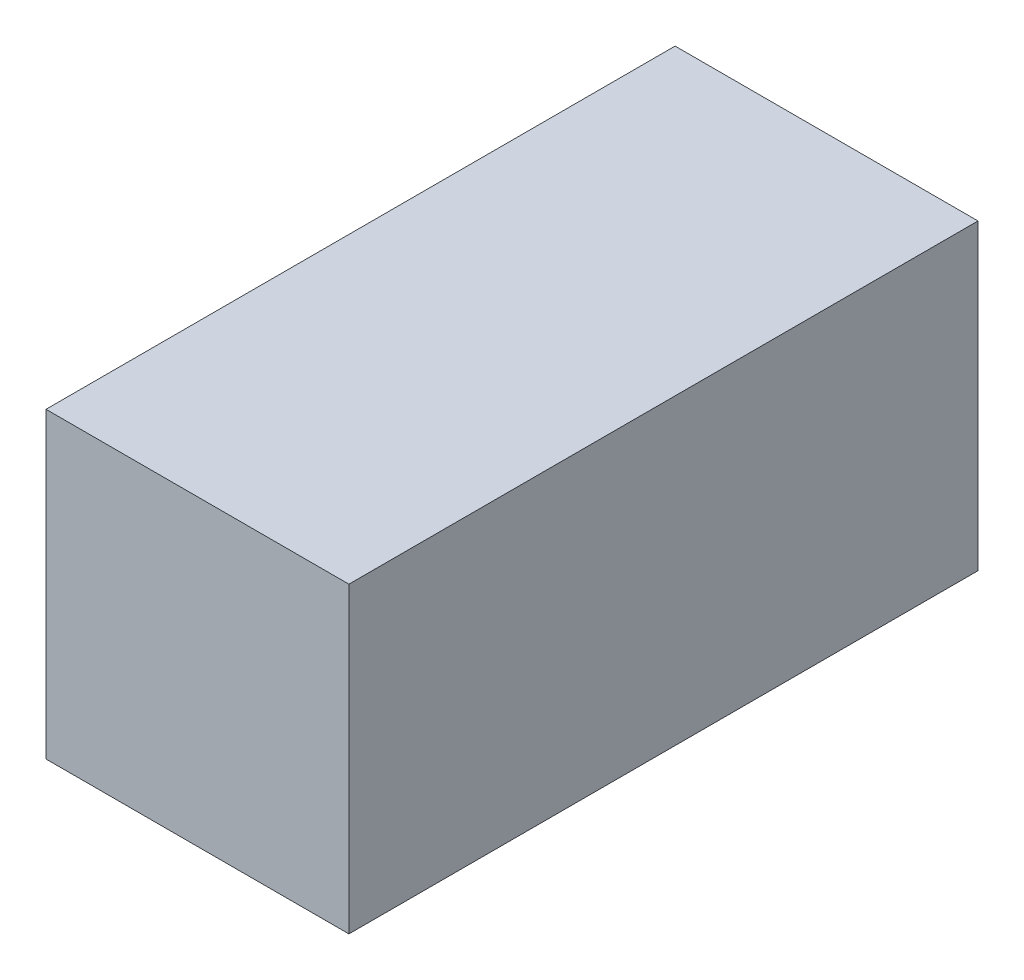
from build123d import *

# Parameters (mm, degrees)
ESQUISSE1_W      = 13
ESQUISSE1_H      = 13
EXTRUSION1_DEPTH = 13.5


with BuildPart() as part:
    # Esquisse1 → Extrusion1 (new, symmetric)
    with BuildSketch(Plane.XY):
        Rectangle(ESQUISSE1_W, ESQUISSE1_H)
    extrude(amount=EXTRUSION1_DEPTH, both=True)


solid = part.part
